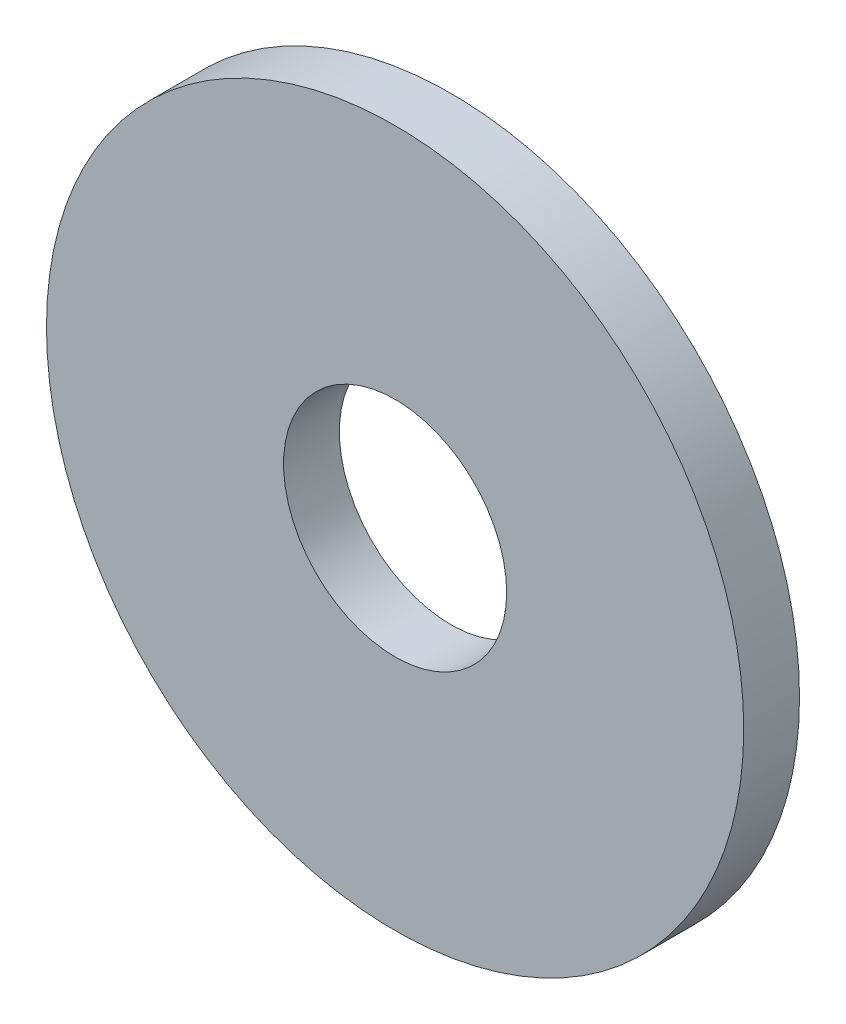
from build123d import *

# Parameters (mm, degrees)
SKETCH1_R          = 12.5
SKETCH1_R_2        = 4
BASE_EXTRUDE_DEPTH = 2


with BuildPart() as part:
    # Sketch1 → Base-Extrude (new body)
    with BuildSketch(Plane.XY):
        Circle(SKETCH1_R)
        Circle(SKETCH1_R_2, mode=Mode.SUBTRACT)
    extrude(amount=BASE_EXTRUDE_DEPTH)


solid = part.part
